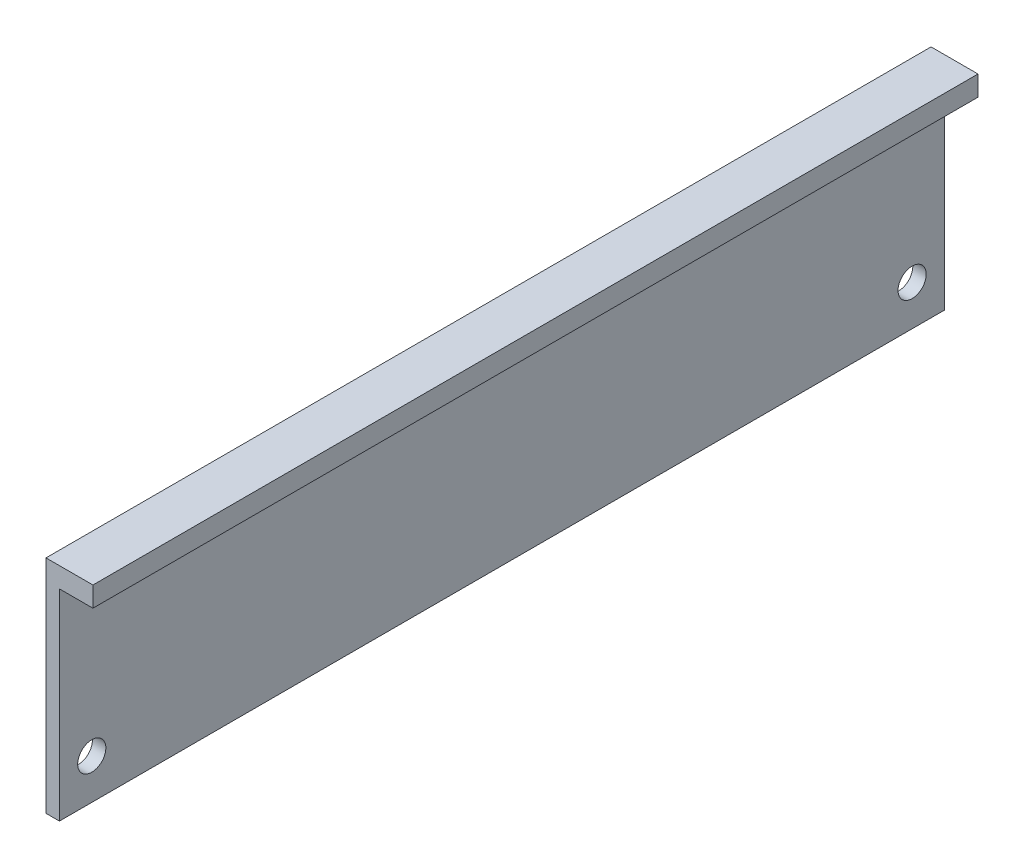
ISO-10303-21;
HEADER;
FILE_DESCRIPTION(('STEP AP214'),'2;1');
FILE_NAME('part.step','',(''),(''),'','','');
FILE_SCHEMA(('AUTOMOTIVE_DESIGN { 1 0 10303 214 1 1 1 1 }'));
ENDSEC;
DATA;
#1=APPLICATION_CONTEXT('core data for automotive mechanical design processes');
#2=APPLICATION_PROTOCOL_DEFINITION('international standard','automotive_design',2000,#1);
#3=PRODUCT_CONTEXT('',#1,'mechanical');
#4=PRODUCT('Part','Part','',(#3));
#5=PRODUCT_RELATED_PRODUCT_CATEGORY('part','',(#4));
#6=PRODUCT_DEFINITION_FORMATION('','',#4);
#7=PRODUCT_DEFINITION_CONTEXT('part definition',#1,'design');
#8=PRODUCT_DEFINITION('design','',#6,#7);
#9=PRODUCT_DEFINITION_SHAPE('','',#8);
#10=(LENGTH_UNIT() NAMED_UNIT(*) SI_UNIT(.MILLI.,.METRE.));
#11=(NAMED_UNIT(*) PLANE_ANGLE_UNIT() SI_UNIT($,.RADIAN.));
#12=(NAMED_UNIT(*) SI_UNIT($,.STERADIAN.) SOLID_ANGLE_UNIT());
#13=UNCERTAINTY_MEASURE_WITH_UNIT(LENGTH_MEASURE(1.E-05),#10,'distance_accuracy_value','');
#14=(GEOMETRIC_REPRESENTATION_CONTEXT(3) GLOBAL_UNCERTAINTY_ASSIGNED_CONTEXT((#13)) GLOBAL_UNIT_ASSIGNED_CONTEXT((#10,
#11,#12)) REPRESENTATION_CONTEXT('',''));
#15=CARTESIAN_POINT('',(0.,0.,0.));
#16=DIRECTION('',(0.,0.,1.));
#17=DIRECTION('',(1.,0.,0.));
#18=AXIS2_PLACEMENT_3D('',#15,#16,#17);
#19=CARTESIAN_POINT('',(4153.36645330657,1695.26594666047,-132.));
#20=DIRECTION('',(1.,0.,0.));
#21=DIRECTION('',(0.,0.,-1.));
#22=AXIS2_PLACEMENT_3D('',#19,#20,#21);
#23=PLANE('',#22);
#24=DIRECTION('',(0.,1.,0.));
#25=VECTOR('',#24,1.);
#26=CARTESIAN_POINT('',(4153.36645330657,0.,-132.));
#27=LINE('',#26,#25);
#28=CARTESIAN_POINT('',(4153.36645330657,1695.26594666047,-132.));
#29=VERTEX_POINT('',#28);
#30=CARTESIAN_POINT('',(4153.36645330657,1692.26594666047,-132.));
#31=VERTEX_POINT('',#30);
#32=EDGE_CURVE('E224',#29,#31,#27,.F.);
#33=ORIENTED_EDGE('',*,*,#32,.F.);
#34=DIRECTION('',(0.,0.,1.));
#35=VECTOR('',#34,1.);
#36=CARTESIAN_POINT('',(4153.36645330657,1695.26594666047,-132.));
#37=LINE('',#36,#35);
#38=CARTESIAN_POINT('',(4153.36645330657,1695.26594666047,0.));
#39=VERTEX_POINT('',#38);
#40=EDGE_CURVE('E74',#39,#29,#37,.F.);
#41=ORIENTED_EDGE('',*,*,#40,.F.);
#42=DIRECTION('',(0.,1.,0.));
#43=VECTOR('',#42,1.);
#44=CARTESIAN_POINT('',(4153.36645330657,0.,0.));
#45=LINE('',#44,#43);
#46=CARTESIAN_POINT('',(4153.36645330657,1692.26594666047,0.));
#47=VERTEX_POINT('',#46);
#48=EDGE_CURVE('E70',#39,#47,#45,.F.);
#49=ORIENTED_EDGE('',*,*,#48,.T.);
#50=DIRECTION('',(0.,0.,-1.));
#51=VECTOR('',#50,1.);
#52=CARTESIAN_POINT('',(4153.36645330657,1692.26594666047,-132.));
#53=LINE('',#52,#51);
#54=EDGE_CURVE('E72',#31,#47,#53,.F.);
#55=ORIENTED_EDGE('',*,*,#54,.F.);
#56=EDGE_LOOP('',(#33,#41,#49,#55));
#57=FACE_BOUND('',#56,.T.);
#58=ADVANCED_FACE('F15',(#57),#23,.T.);
#59=CARTESIAN_POINT('',(4148.36645330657,1692.26594666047,-132.));
#60=DIRECTION('',(0.,-1.,0.));
#61=DIRECTION('',(0.,0.,-1.));
#62=AXIS2_PLACEMENT_3D('',#59,#60,#61);
#63=PLANE('',#62);
#64=DIRECTION('',(-1.,0.,0.));
#65=VECTOR('',#64,1.);
#66=CARTESIAN_POINT('',(0.,1692.26594666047,-132.));
#67=LINE('',#66,#65);
#68=CARTESIAN_POINT('',(4148.36645330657,1692.26594666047,-132.));
#69=VERTEX_POINT('',#68);
#70=EDGE_CURVE('E81',#31,#69,#67,.T.);
#71=ORIENTED_EDGE('',*,*,#70,.F.);
#72=ORIENTED_EDGE('',*,*,#54,.T.);
#73=DIRECTION('',(-1.,0.,0.));
#74=VECTOR('',#73,1.);
#75=CARTESIAN_POINT('',(0.,1692.26594666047,0.));
#76=LINE('',#75,#74);
#77=CARTESIAN_POINT('',(4148.36645330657,1692.26594666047,0.));
#78=VERTEX_POINT('',#77);
#79=EDGE_CURVE('E65',#47,#78,#76,.T.);
#80=ORIENTED_EDGE('',*,*,#79,.T.);
#81=DIRECTION('',(0.,0.,-1.));
#82=VECTOR('',#81,1.);
#83=CARTESIAN_POINT('',(4148.36645330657,1692.26594666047,-132.));
#84=LINE('',#83,#82);
#85=EDGE_CURVE('E83',#69,#78,#84,.F.);
#86=ORIENTED_EDGE('',*,*,#85,.F.);
#87=EDGE_LOOP('',(#71,#72,#80,#86));
#88=FACE_BOUND('',#87,.T.);
#89=ADVANCED_FACE('F79',(#88),#63,.T.);
#90=CARTESIAN_POINT('',(4148.36645330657,1692.26594666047,-132.));
#91=DIRECTION('',(1.,0.,0.));
#92=DIRECTION('',(0.,0.,-1.));
#93=AXIS2_PLACEMENT_3D('',#90,#91,#92);
#94=PLANE('',#93);
#95=DIRECTION('',(0.,1.,0.));
#96=VECTOR('',#95,1.);
#97=CARTESIAN_POINT('',(4148.36645330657,0.,-132.));
#98=LINE('',#97,#96);
#99=CARTESIAN_POINT('',(4148.36645330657,1662.26594666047,-132.));
#100=VERTEX_POINT('',#99);
#101=EDGE_CURVE('E219',#69,#100,#98,.F.);
#102=ORIENTED_EDGE('',*,*,#101,.F.);
#103=ORIENTED_EDGE('',*,*,#85,.T.);
#104=DIRECTION('',(0.,1.,0.));
#105=VECTOR('',#104,1.);
#106=CARTESIAN_POINT('',(4148.36645330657,0.,0.));
#107=LINE('',#106,#105);
#108=CARTESIAN_POINT('',(4148.36645330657,1662.26594666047,0.));
#109=VERTEX_POINT('',#108);
#110=EDGE_CURVE('E88',#78,#109,#107,.F.);
#111=ORIENTED_EDGE('',*,*,#110,.T.);
#112=DIRECTION('',(0.,0.,-1.));
#113=VECTOR('',#112,1.);
#114=CARTESIAN_POINT('',(4148.36645330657,1662.26594666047,-132.));
#115=LINE('',#114,#113);
#116=EDGE_CURVE('E101',#100,#109,#115,.F.);
#117=ORIENTED_EDGE('',*,*,#116,.F.);
#118=EDGE_LOOP('',(#102,#103,#111,#117));
#119=FACE_BOUND('',#118,.T.);
#120=CARTESIAN_POINT('',(4148.36645330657,1668.26594666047,-4.82500000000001));
#121=DIRECTION('',(1.,0.,0.));
#122=DIRECTION('',(0.,0.,-1.));
#123=AXIS2_PLACEMENT_3D('',#120,#121,#122);
#124=CIRCLE('',#123,2.09999999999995);
#125=CARTESIAN_POINT('',(4148.36645330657,1668.26594666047,-6.92499999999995));
#126=VERTEX_POINT('',#125);
#127=EDGE_CURVE('E77',#126,#126,#124,.F.);
#128=ORIENTED_EDGE('',*,*,#127,.T.);
#129=EDGE_LOOP('',(#128));
#130=FACE_BOUND('',#129,.T.);
#131=CARTESIAN_POINT('',(4148.36645330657,1668.26594666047,-127.175));
#132=DIRECTION('',(1.,0.,0.));
#133=DIRECTION('',(0.,0.,-1.));
#134=AXIS2_PLACEMENT_3D('',#131,#132,#133);
#135=CIRCLE('',#134,2.09999999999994);
#136=CARTESIAN_POINT('',(4148.36645330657,1668.26594666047,-129.275));
#137=VERTEX_POINT('',#136);
#138=EDGE_CURVE('E18',#137,#137,#135,.F.);
#139=ORIENTED_EDGE('',*,*,#138,.T.);
#140=EDGE_LOOP('',(#139));
#141=FACE_BOUND('',#140,.T.);
#142=ADVANCED_FACE('F108',(#119,#130,#141),#94,.T.);
#143=CARTESIAN_POINT('',(4146.36645330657,1668.26594666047,-127.175));
#144=DIRECTION('',(1.,0.,0.));
#145=DIRECTION('',(0.,0.,-1.));
#146=AXIS2_PLACEMENT_3D('',#143,#144,#145);
#147=CYLINDRICAL_SURFACE('',#146,2.09999999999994);
#148=ORIENTED_EDGE('',*,*,#138,.F.);
#149=EDGE_LOOP('',(#148));
#150=FACE_BOUND('',#149,.T.);
#151=CARTESIAN_POINT('',(4146.36645330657,1668.26594666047,-127.175));
#152=DIRECTION('',(1.,0.,0.));
#153=DIRECTION('',(0.,0.,-1.));
#154=AXIS2_PLACEMENT_3D('',#151,#152,#153);
#155=CIRCLE('',#154,2.09999999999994);
#156=CARTESIAN_POINT('',(4146.36645330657,1668.26594666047,-129.275));
#157=VERTEX_POINT('',#156);
#158=EDGE_CURVE('E99',#157,#157,#155,.T.);
#159=ORIENTED_EDGE('',*,*,#158,.F.);
#160=EDGE_LOOP('',(#159));
#161=FACE_BOUND('',#160,.T.);
#162=ADVANCED_FACE('F110',(#150,#161),#147,.F.);
#163=CARTESIAN_POINT('',(4146.36645330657,1668.26594666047,-4.82500000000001));
#164=DIRECTION('',(1.,0.,0.));
#165=DIRECTION('',(0.,0.,-1.));
#166=AXIS2_PLACEMENT_3D('',#163,#164,#165);
#167=CYLINDRICAL_SURFACE('',#166,2.09999999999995);
#168=ORIENTED_EDGE('',*,*,#127,.F.);
#169=EDGE_LOOP('',(#168));
#170=FACE_BOUND('',#169,.T.);
#171=CARTESIAN_POINT('',(4146.36645330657,1668.26594666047,-4.82500000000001));
#172=DIRECTION('',(1.,0.,0.));
#173=DIRECTION('',(0.,0.,-1.));
#174=AXIS2_PLACEMENT_3D('',#171,#172,#173);
#175=CIRCLE('',#174,2.09999999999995);
#176=CARTESIAN_POINT('',(4146.36645330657,1668.26594666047,-6.92499999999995));
#177=VERTEX_POINT('',#176);
#178=EDGE_CURVE('E95',#177,#177,#175,.T.);
#179=ORIENTED_EDGE('',*,*,#178,.F.);
#180=EDGE_LOOP('',(#179));
#181=FACE_BOUND('',#180,.T.);
#182=ADVANCED_FACE('F113',(#170,#181),#167,.F.);
#183=CARTESIAN_POINT('',(0.,0.,0.));
#184=DIRECTION('',(0.,0.,-1.));
#185=DIRECTION('',(-1.,0.,0.));
#186=AXIS2_PLACEMENT_3D('',#183,#184,#185);
#187=PLANE('',#186);
#188=DIRECTION('',(0.,1.,0.));
#189=VECTOR('',#188,1.);
#190=CARTESIAN_POINT('',(4146.36645330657,1695.26594666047,0.));
#191=LINE('',#190,#189);
#192=CARTESIAN_POINT('',(4146.36645330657,1662.26594666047,0.));
#193=VERTEX_POINT('',#192);
#194=CARTESIAN_POINT('',(4146.36645330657,1695.26594666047,0.));
#195=VERTEX_POINT('',#194);
#196=EDGE_CURVE('E98',#193,#195,#191,.T.);
#197=ORIENTED_EDGE('',*,*,#196,.F.);
#198=DIRECTION('',(1.,0.,0.));
#199=VECTOR('',#198,1.);
#200=CARTESIAN_POINT('',(4146.36645330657,1662.26594666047,0.));
#201=LINE('',#200,#199);
#202=EDGE_CURVE('E221',#109,#193,#201,.F.);
#203=ORIENTED_EDGE('',*,*,#202,.F.);
#204=ORIENTED_EDGE('',*,*,#110,.F.);
#205=ORIENTED_EDGE('',*,*,#79,.F.);
#206=ORIENTED_EDGE('',*,*,#48,.F.);
#207=DIRECTION('',(1.,0.,0.));
#208=VECTOR('',#207,1.);
#209=CARTESIAN_POINT('',(4146.36645330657,1695.26594666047,0.));
#210=LINE('',#209,#208);
#211=EDGE_CURVE('E90',#195,#39,#210,.T.);
#212=ORIENTED_EDGE('',*,*,#211,.F.);
#213=EDGE_LOOP('',(#197,#203,#204,#205,#206,#212));
#214=FACE_BOUND('',#213,.T.);
#215=ADVANCED_FACE('F86',(#214),#187,.F.);
#216=CARTESIAN_POINT('',(4146.36645330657,1695.26594666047,-132.));
#217=DIRECTION('',(0.,1.,0.));
#218=DIRECTION('',(0.,0.,1.));
#219=AXIS2_PLACEMENT_3D('',#216,#217,#218);
#220=PLANE('',#219);
#221=DIRECTION('',(-1.,0.,0.));
#222=VECTOR('',#221,1.);
#223=CARTESIAN_POINT('',(0.,1695.26594666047,-132.));
#224=LINE('',#223,#222);
#225=CARTESIAN_POINT('',(4146.36645330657,1695.26594666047,-132.));
#226=VERTEX_POINT('',#225);
#227=EDGE_CURVE('E226',#226,#29,#224,.F.);
#228=ORIENTED_EDGE('',*,*,#227,.F.);
#229=DIRECTION('',(0.,0.,1.));
#230=VECTOR('',#229,1.);
#231=CARTESIAN_POINT('',(4146.36645330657,1695.26594666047,-132.));
#232=LINE('',#231,#230);
#233=EDGE_CURVE('E233',#195,#226,#232,.F.);
#234=ORIENTED_EDGE('',*,*,#233,.F.);
#235=ORIENTED_EDGE('',*,*,#211,.T.);
#236=ORIENTED_EDGE('',*,*,#40,.T.);
#237=EDGE_LOOP('',(#228,#234,#235,#236));
#238=FACE_BOUND('',#237,.T.);
#239=ADVANCED_FACE('F134',(#238),#220,.T.);
#240=CARTESIAN_POINT('',(0.,0.,-132.));
#241=DIRECTION('',(0.,0.,-1.));
#242=DIRECTION('',(-1.,0.,0.));
#243=AXIS2_PLACEMENT_3D('',#240,#241,#242);
#244=PLANE('',#243);
#245=DIRECTION('',(1.,0.,0.));
#246=VECTOR('',#245,1.);
#247=CARTESIAN_POINT('',(4146.36645330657,1662.26594666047,-132.));
#248=LINE('',#247,#246);
#249=CARTESIAN_POINT('',(4146.36645330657,1662.26594666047,-132.));
#250=VERTEX_POINT('',#249);
#251=EDGE_CURVE('E33',#250,#100,#248,.T.);
#252=ORIENTED_EDGE('',*,*,#251,.F.);
#253=DIRECTION('',(0.,1.,0.));
#254=VECTOR('',#253,1.);
#255=CARTESIAN_POINT('',(4146.36645330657,1695.26594666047,-132.));
#256=LINE('',#255,#254);
#257=EDGE_CURVE('E24',#226,#250,#256,.F.);
#258=ORIENTED_EDGE('',*,*,#257,.F.);
#259=ORIENTED_EDGE('',*,*,#227,.T.);
#260=ORIENTED_EDGE('',*,*,#32,.T.);
#261=ORIENTED_EDGE('',*,*,#70,.T.);
#262=ORIENTED_EDGE('',*,*,#101,.T.);
#263=EDGE_LOOP('',(#252,#258,#259,#260,#261,#262));
#264=FACE_BOUND('',#263,.T.);
#265=ADVANCED_FACE('F126',(#264),#244,.T.);
#266=CARTESIAN_POINT('',(4146.36645330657,1662.26594666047,-132.));
#267=DIRECTION('',(0.,-1.,0.));
#268=DIRECTION('',(0.,0.,-1.));
#269=AXIS2_PLACEMENT_3D('',#266,#267,#268);
#270=PLANE('',#269);
#271=ORIENTED_EDGE('',*,*,#251,.T.);
#272=ORIENTED_EDGE('',*,*,#116,.T.);
#273=ORIENTED_EDGE('',*,*,#202,.T.);
#274=DIRECTION('',(0.,0.,1.));
#275=VECTOR('',#274,1.);
#276=CARTESIAN_POINT('',(4146.36645330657,1662.26594666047,-132.));
#277=LINE('',#276,#275);
#278=EDGE_CURVE('E10',#250,#193,#277,.T.);
#279=ORIENTED_EDGE('',*,*,#278,.F.);
#280=EDGE_LOOP('',(#271,#272,#273,#279));
#281=FACE_BOUND('',#280,.T.);
#282=ADVANCED_FACE('F119',(#281),#270,.T.);
#283=CARTESIAN_POINT('',(4146.36645330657,1695.26594666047,-132.));
#284=DIRECTION('',(-1.,0.,0.));
#285=DIRECTION('',(0.,0.,1.));
#286=AXIS2_PLACEMENT_3D('',#283,#284,#285);
#287=PLANE('',#286);
#288=ORIENTED_EDGE('',*,*,#257,.T.);
#289=ORIENTED_EDGE('',*,*,#278,.T.);
#290=ORIENTED_EDGE('',*,*,#196,.T.);
#291=ORIENTED_EDGE('',*,*,#233,.T.);
#292=EDGE_LOOP('',(#288,#289,#290,#291));
#293=FACE_BOUND('',#292,.T.);
#294=ORIENTED_EDGE('',*,*,#178,.T.);
#295=EDGE_LOOP('',(#294));
#296=FACE_BOUND('',#295,.T.);
#297=ORIENTED_EDGE('',*,*,#158,.T.);
#298=EDGE_LOOP('',(#297));
#299=FACE_BOUND('',#298,.T.);
#300=ADVANCED_FACE('F117',(#293,#296,#299),#287,.T.);
#301=CLOSED_SHELL('',(#58,#89,#142,#162,#182,#215,#239,#265,#282,#300));
#302=MANIFOLD_SOLID_BREP('B1',#301);
#303=ADVANCED_BREP_SHAPE_REPRESENTATION('',(#18,#302),#14);
#304=SHAPE_DEFINITION_REPRESENTATION(#9,#303);
ENDSEC;
END-ISO-10303-21;
